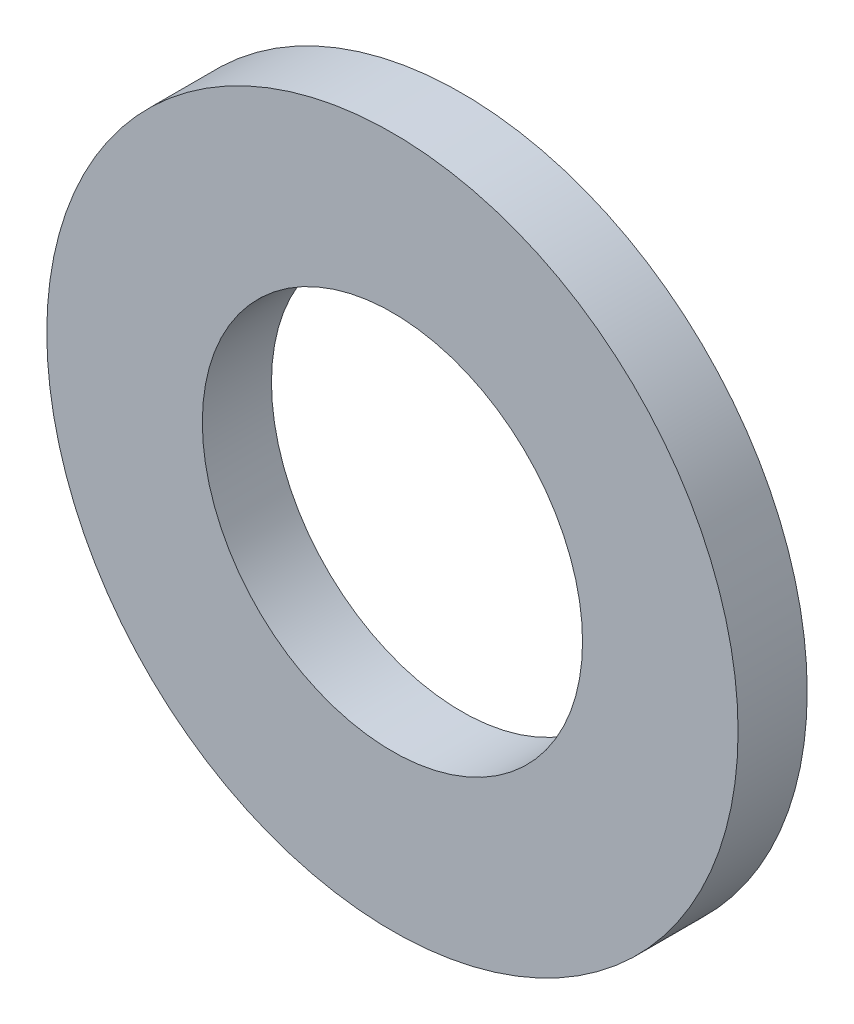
from build123d import *

# Parameters (mm, degrees)
ESQUISSE1_R             = 5
BASE_EXTRUSION_DEPTH    = 1
ESQUISSE2_R             = 2.75
ENL_V_MAT_EXTRU_1_DEPTH = 1


with BuildPart() as part:
    # Esquisse1 → Base-Extrusion (new body)
    with BuildSketch(Plane.XY):
        Circle(ESQUISSE1_R)
    extrude(amount=BASE_EXTRUSION_DEPTH)

    # Esquisse2 → Enl_v. mat.-Extru.1 (cut)
    with BuildSketch(Plane(origin=(0, 0, 0), x_dir=(-1, 0, 0), z_dir=(0, 0, -1))):
        Circle(ESQUISSE2_R)
    extrude(amount=-ENL_V_MAT_EXTRU_1_DEPTH, mode=Mode.SUBTRACT)


solid = part.part
